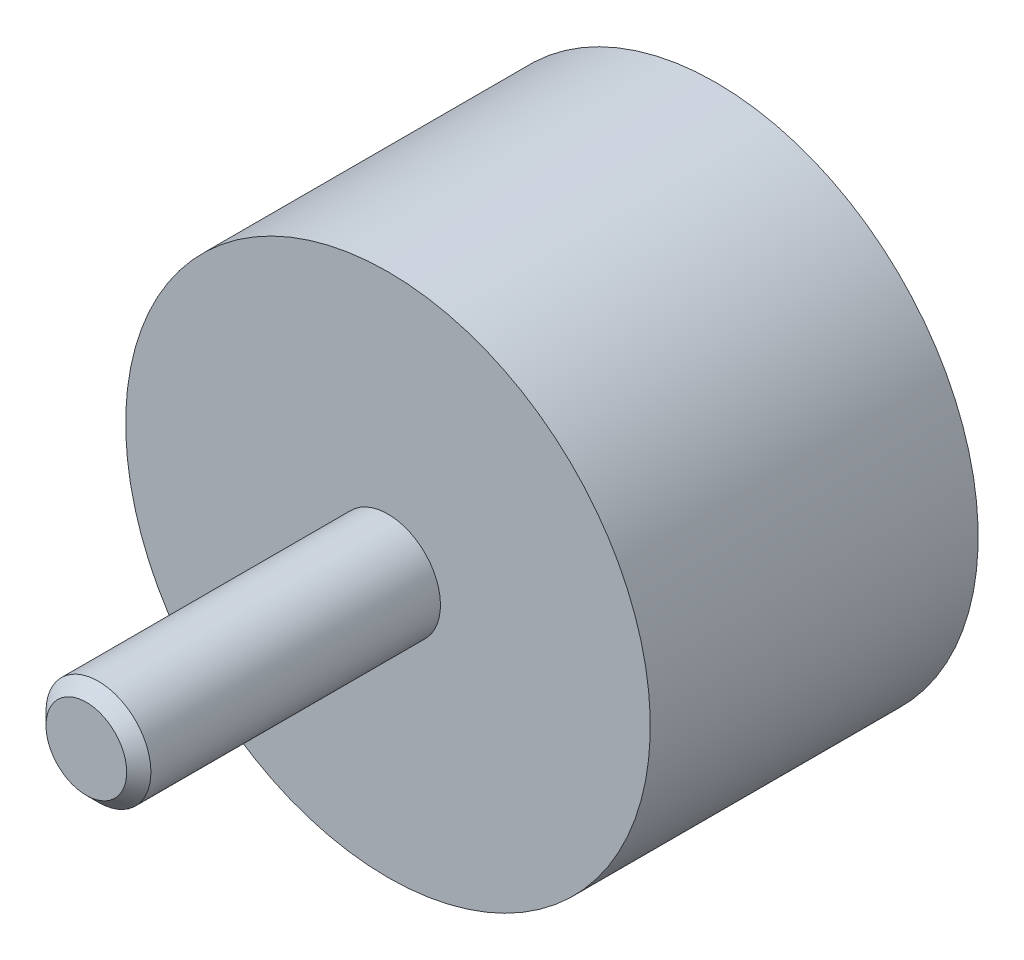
ISO-10303-21;
HEADER;
FILE_DESCRIPTION(('STEP AP214'),'2;1');
FILE_NAME('part.step','',(''),(''),'','','');
FILE_SCHEMA(('AUTOMOTIVE_DESIGN { 1 0 10303 214 1 1 1 1 }'));
ENDSEC;
DATA;
#1=APPLICATION_CONTEXT('core data for automotive mechanical design processes');
#2=APPLICATION_PROTOCOL_DEFINITION('international standard','automotive_design',2000,#1);
#3=PRODUCT_CONTEXT('',#1,'mechanical');
#4=PRODUCT('Part','Part','',(#3));
#5=PRODUCT_RELATED_PRODUCT_CATEGORY('part','',(#4));
#6=PRODUCT_DEFINITION_FORMATION('','',#4);
#7=PRODUCT_DEFINITION_CONTEXT('part definition',#1,'design');
#8=PRODUCT_DEFINITION('design','',#6,#7);
#9=PRODUCT_DEFINITION_SHAPE('','',#8);
#10=(LENGTH_UNIT() NAMED_UNIT(*) SI_UNIT(.MILLI.,.METRE.));
#11=(NAMED_UNIT(*) PLANE_ANGLE_UNIT() SI_UNIT($,.RADIAN.));
#12=(NAMED_UNIT(*) SI_UNIT($,.STERADIAN.) SOLID_ANGLE_UNIT());
#13=UNCERTAINTY_MEASURE_WITH_UNIT(LENGTH_MEASURE(1.E-05),#10,'distance_accuracy_value','');
#14=(GEOMETRIC_REPRESENTATION_CONTEXT(3) GLOBAL_UNCERTAINTY_ASSIGNED_CONTEXT((#13)) GLOBAL_UNIT_ASSIGNED_CONTEXT((#10,
#11,#12)) REPRESENTATION_CONTEXT('',''));
#15=CARTESIAN_POINT('',(0.,0.,0.));
#16=DIRECTION('',(0.,0.,1.));
#17=DIRECTION('',(1.,0.,0.));
#18=AXIS2_PLACEMENT_3D('',#15,#16,#17);
#19=CARTESIAN_POINT('',(0.,0.,0.));
#20=DIRECTION('',(0.,0.,1.));
#21=DIRECTION('',(0.,-1.,0.));
#22=AXIS2_PLACEMENT_3D('',#19,#20,#21);
#23=CYLINDRICAL_SURFACE('',#22,20.);
#24=CARTESIAN_POINT('',(0.,0.,0.));
#25=DIRECTION('',(0.,0.,1.));
#26=DIRECTION('',(0.,-1.,0.));
#27=AXIS2_PLACEMENT_3D('',#24,#25,#26);
#28=CIRCLE('',#27,20.);
#29=CARTESIAN_POINT('',(0.,-20.,0.));
#30=VERTEX_POINT('',#29);
#31=EDGE_CURVE('E8',#30,#30,#28,.T.);
#32=ORIENTED_EDGE('',*,*,#31,.T.);
#33=EDGE_LOOP('',(#32));
#34=FACE_BOUND('',#33,.T.);
#35=CARTESIAN_POINT('',(0.,0.,25.));
#36=DIRECTION('',(0.,0.,1.));
#37=DIRECTION('',(0.,-1.,0.));
#38=AXIS2_PLACEMENT_3D('',#35,#36,#37);
#39=CIRCLE('',#38,20.);
#40=CARTESIAN_POINT('',(0.,-20.,25.));
#41=VERTEX_POINT('',#40);
#42=EDGE_CURVE('E18',#41,#41,#39,.T.);
#43=ORIENTED_EDGE('',*,*,#42,.F.);
#44=EDGE_LOOP('',(#43));
#45=FACE_BOUND('',#44,.T.);
#46=ADVANCED_FACE('F12',(#34,#45),#23,.T.);
#47=CARTESIAN_POINT('',(20.,0.,0.));
#48=DIRECTION('',(0.,0.,-1.));
#49=DIRECTION('',(0.,1.,0.));
#50=AXIS2_PLACEMENT_3D('',#47,#48,#49);
#51=PLANE('',#50);
#52=ORIENTED_EDGE('',*,*,#31,.F.);
#53=EDGE_LOOP('',(#52));
#54=FACE_BOUND('',#53,.T.);
#55=ADVANCED_FACE('F52',(#54),#51,.T.);
#56=CARTESIAN_POINT('',(20.,0.,25.));
#57=DIRECTION('',(0.,0.,-1.));
#58=DIRECTION('',(0.,1.,0.));
#59=AXIS2_PLACEMENT_3D('',#56,#57,#58);
#60=PLANE('',#59);
#61=CARTESIAN_POINT('',(0.,0.,25.));
#62=DIRECTION('',(0.,0.,1.));
#63=DIRECTION('',(0.,-1.,0.));
#64=AXIS2_PLACEMENT_3D('',#61,#62,#63);
#65=CIRCLE('',#64,4.);
#66=CARTESIAN_POINT('',(0.,-4.,25.));
#67=VERTEX_POINT('',#66);
#68=EDGE_CURVE('E22',#67,#67,#65,.T.);
#69=ORIENTED_EDGE('',*,*,#68,.F.);
#70=EDGE_LOOP('',(#69));
#71=FACE_BOUND('',#70,.T.);
#72=ORIENTED_EDGE('',*,*,#42,.T.);
#73=EDGE_LOOP('',(#72));
#74=FACE_BOUND('',#73,.T.);
#75=ADVANCED_FACE('F45',(#71,#74),#60,.F.);
#76=CARTESIAN_POINT('',(0.,0.,20.));
#77=DIRECTION('',(0.,0.,1.));
#78=DIRECTION('',(0.,-1.,0.));
#79=AXIS2_PLACEMENT_3D('',#76,#77,#78);
#80=CYLINDRICAL_SURFACE('',#79,4.);
#81=ORIENTED_EDGE('',*,*,#68,.T.);
#82=EDGE_LOOP('',(#81));
#83=FACE_BOUND('',#82,.T.);
#84=CARTESIAN_POINT('',(0.,0.,47.0763248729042));
#85=DIRECTION('',(0.,0.,1.));
#86=DIRECTION('',(0.,-1.,0.));
#87=AXIS2_PLACEMENT_3D('',#84,#85,#86);
#88=CIRCLE('',#87,4.);
#89=CARTESIAN_POINT('',(0.,-4.,47.0763248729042));
#90=VERTEX_POINT('',#89);
#91=EDGE_CURVE('E26',#90,#90,#88,.T.);
#92=ORIENTED_EDGE('',*,*,#91,.F.);
#93=EDGE_LOOP('',(#92));
#94=FACE_BOUND('',#93,.T.);
#95=ADVANCED_FACE('F40',(#83,#94),#80,.T.);
#96=CARTESIAN_POINT('',(0.,0.,47.0763248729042));
#97=DIRECTION('',(0.,0.,-1.));
#98=DIRECTION('',(0.,1.,0.));
#99=AXIS2_PLACEMENT_3D('',#96,#97,#98);
#100=CONICAL_SURFACE('',#99,4.,0.785398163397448);
#101=CARTESIAN_POINT('',(0.,0.,48.));
#102=DIRECTION('',(0.,0.,1.));
#103=DIRECTION('',(0.,-1.,0.));
#104=AXIS2_PLACEMENT_3D('',#101,#102,#103);
#105=CIRCLE('',#104,3.07632487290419);
#106=CARTESIAN_POINT('',(0.,-3.07632487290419,48.));
#107=VERTEX_POINT('',#106);
#108=EDGE_CURVE('E31',#107,#107,#105,.T.);
#109=ORIENTED_EDGE('',*,*,#108,.F.);
#110=EDGE_LOOP('',(#109));
#111=FACE_BOUND('',#110,.T.);
#112=ORIENTED_EDGE('',*,*,#91,.T.);
#113=EDGE_LOOP('',(#112));
#114=FACE_BOUND('',#113,.T.);
#115=ADVANCED_FACE('F37',(#111,#114),#100,.T.);
#116=CARTESIAN_POINT('',(3.07632487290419,0.,48.));
#117=DIRECTION('',(0.,0.,-1.));
#118=DIRECTION('',(0.,1.,0.));
#119=AXIS2_PLACEMENT_3D('',#116,#117,#118);
#120=PLANE('',#119);
#121=ORIENTED_EDGE('',*,*,#108,.T.);
#122=EDGE_LOOP('',(#121));
#123=FACE_BOUND('',#122,.T.);
#124=ADVANCED_FACE('F35',(#123),#120,.F.);
#125=CLOSED_SHELL('',(#46,#55,#75,#95,#115,#124));
#126=MANIFOLD_SOLID_BREP('B1',#125);
#127=ADVANCED_BREP_SHAPE_REPRESENTATION('',(#18,#126),#14);
#128=SHAPE_DEFINITION_REPRESENTATION(#9,#127);
ENDSEC;
END-ISO-10303-21;
